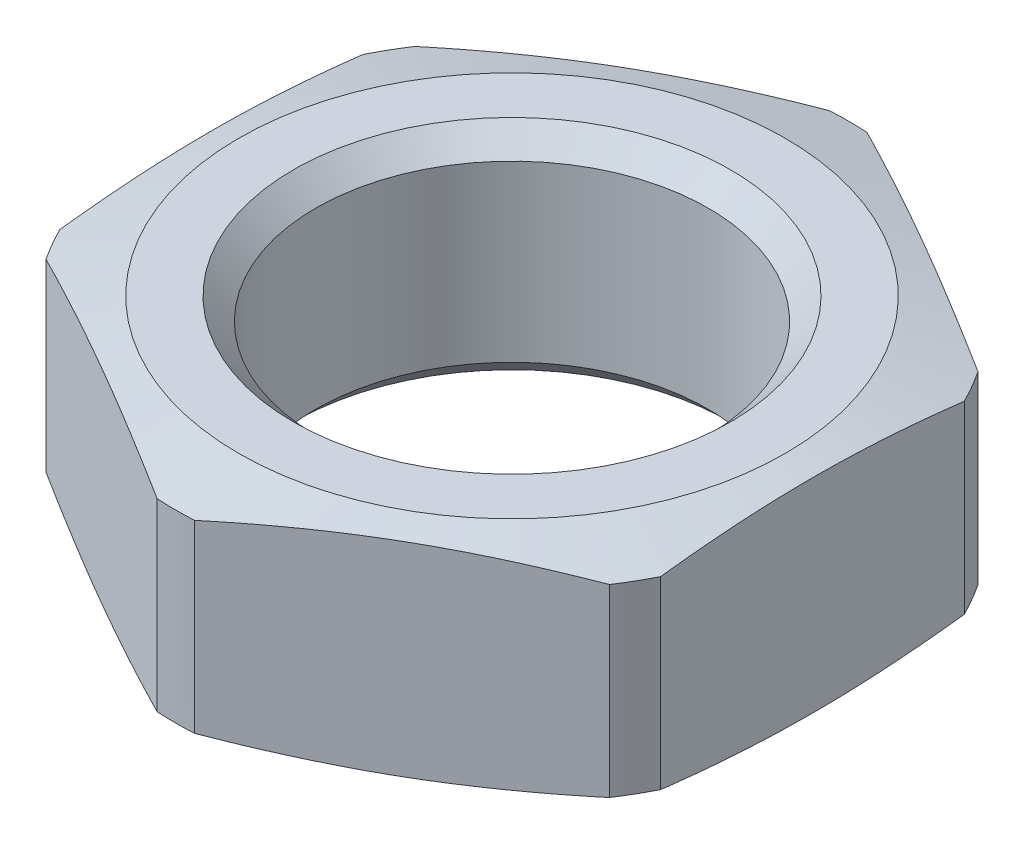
ISO-10303-21;
HEADER;
FILE_DESCRIPTION(('STEP AP214'),'2;1');
FILE_NAME('part.step','',(''),(''),'','','');
FILE_SCHEMA(('AUTOMOTIVE_DESIGN { 1 0 10303 214 1 1 1 1 }'));
ENDSEC;
DATA;
#1=APPLICATION_CONTEXT('core data for automotive mechanical design processes');
#2=APPLICATION_PROTOCOL_DEFINITION('international standard','automotive_design',2000,#1);
#3=PRODUCT_CONTEXT('',#1,'mechanical');
#4=PRODUCT('Part','Part','',(#3));
#5=PRODUCT_RELATED_PRODUCT_CATEGORY('part','',(#4));
#6=PRODUCT_DEFINITION_FORMATION('','',#4);
#7=PRODUCT_DEFINITION_CONTEXT('part definition',#1,'design');
#8=PRODUCT_DEFINITION('design','',#6,#7);
#9=PRODUCT_DEFINITION_SHAPE('','',#8);
#10=(LENGTH_UNIT() NAMED_UNIT(*) SI_UNIT(.MILLI.,.METRE.));
#11=(NAMED_UNIT(*) PLANE_ANGLE_UNIT() SI_UNIT($,.RADIAN.));
#12=(NAMED_UNIT(*) SI_UNIT($,.STERADIAN.) SOLID_ANGLE_UNIT());
#13=UNCERTAINTY_MEASURE_WITH_UNIT(LENGTH_MEASURE(1.E-05),#10,'distance_accuracy_value','');
#14=(GEOMETRIC_REPRESENTATION_CONTEXT(3) GLOBAL_UNCERTAINTY_ASSIGNED_CONTEXT((#13)) GLOBAL_UNIT_ASSIGNED_CONTEXT((#10,
#11,#12)) REPRESENTATION_CONTEXT('',''));
#15=CARTESIAN_POINT('',(0.,0.,0.));
#16=DIRECTION('',(0.,0.,1.));
#17=DIRECTION('',(1.,0.,0.));
#18=AXIS2_PLACEMENT_3D('',#15,#16,#17);
#19=CARTESIAN_POINT('',(0.,0.,0.));
#20=DIRECTION('',(0.,1.,0.));
#21=DIRECTION('',(0.,0.,1.));
#22=AXIS2_PLACEMENT_3D('',#19,#20,#21);
#23=CONICAL_SURFACE('',#22,5.,1.30899693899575);
#24=CARTESIAN_POINT('',(0.,0.,0.));
#25=DIRECTION('',(0.,1.,0.));
#26=DIRECTION('',(0.,0.,1.));
#27=AXIS2_PLACEMENT_3D('',#24,#25,#26);
#28=CIRCLE('',#27,5.);
#29=CARTESIAN_POINT('',(0.,0.,5.));
#30=VERTEX_POINT('',#29);
#31=EDGE_CURVE('E544',#30,#30,#28,.T.);
#32=ORIENTED_EDGE('',*,*,#31,.T.);
#33=EDGE_LOOP('',(#32));
#34=FACE_BOUND('',#33,.T.);
#35=CARTESIAN_POINT('',(0.,0.311481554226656,0.));
#36=DIRECTION('',(0.,1.,0.));
#37=DIRECTION('',(0.,0.,1.));
#38=AXIS2_PLACEMENT_3D('',#35,#36,#37);
#39=CIRCLE('',#38,6.1624649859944);
#40=CARTESIAN_POINT('',(5.15717282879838,0.311481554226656,3.37335784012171));
#41=VERTEX_POINT('',#40);
#42=CARTESIAN_POINT('',(5.5,0.311481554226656,2.7795637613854));
#43=VERTEX_POINT('',#42);
#44=EDGE_CURVE('E261',#41,#43,#39,.T.);
#45=ORIENTED_EDGE('',*,*,#44,.F.);
#46=CARTESIAN_POINT('',(-0.000200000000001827,0.361990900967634,6.35096843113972));
#47=CARTESIAN_POINT('',(0.22821775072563,0.32663925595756,6.21909138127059));
#48=CARTESIAN_POINT('',(0.457049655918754,0.294545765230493,6.08697521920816));
#49=CARTESIAN_POINT('',(0.915521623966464,0.238160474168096,5.82227630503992));
#50=CARTESIAN_POINT('',(1.14516197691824,0.213871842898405,5.68969338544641));
#51=CARTESIAN_POINT('',(1.60385849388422,0.17451425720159,5.42486482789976));
#52=CARTESIAN_POINT('',(1.8329115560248,0.159398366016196,5.29262098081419));
#53=CARTESIAN_POINT('',(2.29130978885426,0.139129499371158,5.02796463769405));
#54=CARTESIAN_POINT('',(2.52065489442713,0.133974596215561,4.89555217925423));
#55=CARTESIAN_POINT('',(2.97934510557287,0.133974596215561,4.63072726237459));
#56=CARTESIAN_POINT('',(3.20869021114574,0.139129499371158,4.49831480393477));
#57=CARTESIAN_POINT('',(3.6670884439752,0.159398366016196,4.23365846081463));
#58=CARTESIAN_POINT('',(3.89614150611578,0.17451425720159,4.10141461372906));
#59=CARTESIAN_POINT('',(4.35483802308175,0.213871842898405,3.83658605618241));
#60=CARTESIAN_POINT('',(4.58447837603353,0.238160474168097,3.7040031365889));
#61=CARTESIAN_POINT('',(5.04295034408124,0.294545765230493,3.43930422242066));
#62=CARTESIAN_POINT('',(5.27178224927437,0.326639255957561,3.30718806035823));
#63=CARTESIAN_POINT('',(5.5002,0.361990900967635,3.1753110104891));
#64=B_SPLINE_CURVE_WITH_KNOTS('',3,(#46,#47,#48,#49,#50,#51,#52,#53,#54,#55,#56,#57,#58,#59,#60,
#61,#62,#63),.UNSPECIFIED.,.F.,.F.,(4,2,2,2,2,2,2,2,4),(0.,0.798379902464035,1.59708356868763,
2.3916650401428,3.1860927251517,3.9805204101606,4.77510188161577,5.57380554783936,
6.37218545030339),.UNSPECIFIED.);
#65=CARTESIAN_POINT('',(0.342827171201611,0.311481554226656,6.15292160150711));
#66=VERTEX_POINT('',#65);
#67=EDGE_CURVE('E169',#66,#41,#64,.T.);
#68=ORIENTED_EDGE('',*,*,#67,.F.);
#69=CARTESIAN_POINT('',(-0.342827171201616,0.311481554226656,6.15292160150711));
#70=VERTEX_POINT('',#69);
#71=EDGE_CURVE('E246',#70,#66,#39,.T.);
#72=ORIENTED_EDGE('',*,*,#71,.F.);
#73=CARTESIAN_POINT('',(-5.5002,0.361990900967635,3.1753110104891));
#74=CARTESIAN_POINT('',(-5.27178224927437,0.326639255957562,3.30718806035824));
#75=CARTESIAN_POINT('',(-5.04295034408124,0.294545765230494,3.43930422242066));
#76=CARTESIAN_POINT('',(-4.58447837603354,0.238160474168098,3.70400313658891));
#77=CARTESIAN_POINT('',(-4.35483802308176,0.213871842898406,3.83658605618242));
#78=CARTESIAN_POINT('',(-3.89614150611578,0.174514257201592,4.10141461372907));
#79=CARTESIAN_POINT('',(-3.6670884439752,0.159398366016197,4.23365846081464));
#80=CARTESIAN_POINT('',(-3.20869021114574,0.13912949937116,4.49831480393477));
#81=CARTESIAN_POINT('',(-2.97934510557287,0.133974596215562,4.63072726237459));
#82=CARTESIAN_POINT('',(-2.52065489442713,0.133974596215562,4.89555217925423));
#83=CARTESIAN_POINT('',(-2.29130978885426,0.13912949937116,5.02796463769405));
#84=CARTESIAN_POINT('',(-1.8329115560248,0.159398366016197,5.29262098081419));
#85=CARTESIAN_POINT('',(-1.60385849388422,0.174514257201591,5.42486482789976));
#86=CARTESIAN_POINT('',(-1.14516197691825,0.213871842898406,5.68969338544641));
#87=CARTESIAN_POINT('',(-0.91552162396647,0.238160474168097,5.82227630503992));
#88=CARTESIAN_POINT('',(-0.45704965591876,0.294545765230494,6.08697521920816));
#89=CARTESIAN_POINT('',(-0.228217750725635,0.326639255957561,6.21909138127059));
#90=CARTESIAN_POINT('',(0.000199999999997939,0.361990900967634,6.35096843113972));
#91=B_SPLINE_CURVE_WITH_KNOTS('',3,(#73,#74,#75,#76,#77,#78,#79,#80,#81,#82,#83,#84,#85,#86,#87,
#88,#89,#90),.UNSPECIFIED.,.F.,.F.,(4,2,2,2,2,2,2,2,4),(0.,0.798379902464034,1.59708356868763,
2.3916650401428,3.18609272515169,3.98052041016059,4.77510188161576,5.57380554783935,
6.37218545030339),.UNSPECIFIED.);
#92=CARTESIAN_POINT('',(-5.15717282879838,0.311481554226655,3.37335784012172));
#93=VERTEX_POINT('',#92);
#94=EDGE_CURVE('E162',#93,#70,#91,.T.);
#95=ORIENTED_EDGE('',*,*,#94,.F.);
#96=CARTESIAN_POINT('',(-5.5,0.311481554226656,2.7795637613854));
#97=VERTEX_POINT('',#96);
#98=EDGE_CURVE('E109',#97,#93,#39,.T.);
#99=ORIENTED_EDGE('',*,*,#98,.F.);
#100=CARTESIAN_POINT('',(-5.5,1.37396411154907,-8.50413932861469));
#101=CARTESIAN_POINT('',(-5.5,1.31755688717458,-8.25336836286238));
#102=CARTESIAN_POINT('',(-5.5,1.26182243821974,-8.00244337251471));
#103=CARTESIAN_POINT('',(-5.5,1.15206250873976,-7.50020944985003));
#104=CARTESIAN_POINT('',(-5.5,1.09803709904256,-7.24890050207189));
#105=CARTESIAN_POINT('',(-5.5,0.992015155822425,-6.74561452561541));
#106=CARTESIAN_POINT('',(-5.5,0.94002051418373,-6.49363709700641));
#107=CARTESIAN_POINT('',(-5.5,0.838604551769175,-5.98916516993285));
#108=CARTESIAN_POINT('',(-5.5,0.789183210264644,-5.73667067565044));
#109=CARTESIAN_POINT('',(-5.5,0.693926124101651,-5.23317212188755));
#110=CARTESIAN_POINT('',(-5.5,0.648064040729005,-4.98217306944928));
#111=CARTESIAN_POINT('',(-5.5,0.560230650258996,-4.47949627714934));
#112=CARTESIAN_POINT('',(-5.5,0.518259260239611,-4.22781855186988));
#113=CARTESIAN_POINT('',(-5.5,0.43912969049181,-3.72372130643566));
#114=CARTESIAN_POINT('',(-5.5,0.401971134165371,-3.47130184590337));
#115=CARTESIAN_POINT('',(-5.5,0.333543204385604,-2.9656567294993));
#116=CARTESIAN_POINT('',(-5.5,0.302273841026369,-2.71243107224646));
#117=CARTESIAN_POINT('',(-5.5,0.24648502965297,-2.20226254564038));
#118=CARTESIAN_POINT('',(-5.5,0.222047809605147,-1.9453105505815));
#119=CARTESIAN_POINT('',(-5.5,0.181596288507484,-1.43073857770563));
#120=CARTESIAN_POINT('',(-5.5,0.165581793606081,-1.17311861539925));
#121=CARTESIAN_POINT('',(-5.5,0.142908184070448,-0.657591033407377));
#122=CARTESIAN_POINT('',(-5.5,0.136244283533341,-0.399683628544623));
#123=CARTESIAN_POINT('',(-5.5,0.132683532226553,0.116199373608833));
#124=CARTESIAN_POINT('',(-5.5,0.13578665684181,0.374174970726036));
#125=CARTESIAN_POINT('',(-5.5,0.151589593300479,0.890862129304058));
#126=CARTESIAN_POINT('',(-5.5,0.164327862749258,1.14957249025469));
#127=CARTESIAN_POINT('',(-5.5,0.198668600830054,1.66639884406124));
#128=CARTESIAN_POINT('',(-5.5,0.220271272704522,1.92451482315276));
#129=CARTESIAN_POINT('',(-5.5,0.271224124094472,2.44015244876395));
#130=CARTESIAN_POINT('',(-5.5,0.300579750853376,2.69767354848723));
#131=CARTESIAN_POINT('',(-5.5,0.365784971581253,3.21188197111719));
#132=CARTESIAN_POINT('',(-5.5,0.401634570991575,3.46856929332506));
#133=CARTESIAN_POINT('',(-5.5,0.480460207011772,3.99319758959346));
#134=CARTESIAN_POINT('',(-5.5,0.523692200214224,4.26109975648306));
#135=CARTESIAN_POINT('',(-5.5,0.614815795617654,4.79611488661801));
#136=CARTESIAN_POINT('',(-5.5,0.662707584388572,5.06322781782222));
#137=CARTESIAN_POINT('',(-5.5,0.762202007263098,5.59679417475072));
#138=CARTESIAN_POINT('',(-5.5,0.813805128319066,5.86324750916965));
#139=CARTESIAN_POINT('',(-5.5,0.919969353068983,6.39556585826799));
#140=CARTESIAN_POINT('',(-5.5,0.974530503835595,6.6614308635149));
#141=CARTESIAN_POINT('',(-5.5,1.14177407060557,7.45848507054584));
#142=CARTESIAN_POINT('',(-5.5,1.25797841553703,7.98893401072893));
#143=CARTESIAN_POINT('',(-5.5,1.496487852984,9.0483960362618));
#144=CARTESIAN_POINT('',(-5.5,1.61879243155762,9.57740923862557));
#145=CARTESIAN_POINT('',(-5.5,1.86611349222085,10.6282572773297));
#146=CARTESIAN_POINT('',(-5.5,1.99108138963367,11.1501035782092));
#147=CARTESIAN_POINT('',(-5.5,2.24389518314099,12.1931106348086));
#148=CARTESIAN_POINT('',(-5.5,2.37174115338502,12.714271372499));
#149=CARTESIAN_POINT('',(-5.5,2.62931738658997,13.7552700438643));
#150=CARTESIAN_POINT('',(-5.5,2.75904442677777,14.2751087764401));
#151=CARTESIAN_POINT('',(-5.5,3.02007748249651,15.3143681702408));
#152=CARTESIAN_POINT('',(-5.5,3.15138343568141,15.8337888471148));
#153=CARTESIAN_POINT('',(-5.5,3.28323479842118,16.353069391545));
#154=B_SPLINE_CURVE_WITH_KNOTS('',3,(#100,#101,#102,#103,#104,#105,#106,#107,#108,#109,#110,
#111,#112,#113,#114,#115,#116,#117,#118,#119,#120,#121,#122,#123,#124,#125,#126,#127,#128,#129,
#130,#131,#132,#133,#134,#135,#136,#137,#138,#139,#140,#141,#142,#143,#144,#145,#146,#147,#148,
#149,#150,#151,#152,#153),.UNSPECIFIED.,.F.,.F.,(4,2,2,2,2,2,2,2,2,2,2,2,2,2,2,2,2,2,2,2,2,2,2,
2,2,2,4),(0.,0.771113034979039,1.54225798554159,2.31410499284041,3.08594578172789,
3.85138506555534,4.61680803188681,5.38217106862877,6.1475354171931,6.92174945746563,
7.6959456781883,8.46974549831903,9.2435433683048,10.0204461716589,10.7973667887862,
11.5748347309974,12.3523033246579,13.1663555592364,13.9804404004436,14.7946322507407,
15.6088370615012,17.2378558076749,18.8667375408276,20.4765283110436,22.0863606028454,
23.6937012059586,25.3009785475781),.UNSPECIFIED.);
#155=CARTESIAN_POINT('',(-5.5,0.311481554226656,-2.7795637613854));
#156=VERTEX_POINT('',#155);
#157=EDGE_CURVE('E208',#156,#97,#154,.T.);
#158=ORIENTED_EDGE('',*,*,#157,.F.);
#159=CARTESIAN_POINT('',(-5.15717282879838,0.311481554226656,-3.37335784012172));
#160=VERTEX_POINT('',#159);
#161=EDGE_CURVE('E249',#160,#156,#39,.T.);
#162=ORIENTED_EDGE('',*,*,#161,.F.);
#163=CARTESIAN_POINT('',(0.000199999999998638,0.361990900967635,-6.35096843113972));
#164=CARTESIAN_POINT('',(-0.228217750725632,0.326639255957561,-6.21909138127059));
#165=CARTESIAN_POINT('',(-0.457049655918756,0.294545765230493,-6.08697521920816));
#166=CARTESIAN_POINT('',(-0.915521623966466,0.238160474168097,-5.82227630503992));
#167=CARTESIAN_POINT('',(-1.14516197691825,0.213871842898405,-5.68969338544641));
#168=CARTESIAN_POINT('',(-1.60385849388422,0.174514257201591,-5.42486482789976));
#169=CARTESIAN_POINT('',(-1.8329115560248,0.159398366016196,-5.29262098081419));
#170=CARTESIAN_POINT('',(-2.29130978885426,0.139129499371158,-5.02796463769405));
#171=CARTESIAN_POINT('',(-2.52065489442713,0.133974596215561,-4.89555217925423));
#172=CARTESIAN_POINT('',(-2.97934510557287,0.133974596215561,-4.63072726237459));
#173=CARTESIAN_POINT('',(-3.20869021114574,0.139129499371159,-4.49831480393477));
#174=CARTESIAN_POINT('',(-3.6670884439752,0.159398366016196,-4.23365846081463));
#175=CARTESIAN_POINT('',(-3.89614150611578,0.174514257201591,-4.10141461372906));
#176=CARTESIAN_POINT('',(-4.35483802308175,0.213871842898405,-3.83658605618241));
#177=CARTESIAN_POINT('',(-4.58447837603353,0.238160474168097,-3.7040031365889));
#178=CARTESIAN_POINT('',(-5.04295034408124,0.294545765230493,-3.43930422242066));
#179=CARTESIAN_POINT('',(-5.27178224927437,0.326639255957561,-3.30718806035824));
#180=CARTESIAN_POINT('',(-5.5002,0.361990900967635,-3.1753110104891));
#181=B_SPLINE_CURVE_WITH_KNOTS('',3,(#163,#164,#165,#166,#167,#168,#169,#170,#171,#172,#173,
#174,#175,#176,#177,#178,#179,#180),.UNSPECIFIED.,.F.,.F.,(4,2,2,2,2,2,2,2,4),(0.,
0.798379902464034,1.59708356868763,2.3916650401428,3.18609272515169,3.98052041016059,
4.77510188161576,5.57380554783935,6.37218545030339),.UNSPECIFIED.);
#182=CARTESIAN_POINT('',(-0.342827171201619,0.311481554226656,-6.15292160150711));
#183=VERTEX_POINT('',#182);
#184=EDGE_CURVE('E201',#183,#160,#181,.T.);
#185=ORIENTED_EDGE('',*,*,#184,.F.);
#186=CARTESIAN_POINT('',(0.342827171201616,0.311481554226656,-6.15292160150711));
#187=VERTEX_POINT('',#186);
#188=EDGE_CURVE('E274',#187,#183,#39,.T.);
#189=ORIENTED_EDGE('',*,*,#188,.F.);
#190=CARTESIAN_POINT('',(5.5002,0.361990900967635,-3.1753110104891));
#191=CARTESIAN_POINT('',(5.27178224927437,0.326639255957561,-3.30718806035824));
#192=CARTESIAN_POINT('',(5.04295034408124,0.294545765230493,-3.43930422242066));
#193=CARTESIAN_POINT('',(4.58447837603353,0.238160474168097,-3.7040031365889));
#194=CARTESIAN_POINT('',(4.35483802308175,0.213871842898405,-3.83658605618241));
#195=CARTESIAN_POINT('',(3.89614150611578,0.174514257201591,-4.10141461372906));
#196=CARTESIAN_POINT('',(3.6670884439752,0.159398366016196,-4.23365846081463));
#197=CARTESIAN_POINT('',(3.20869021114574,0.139129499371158,-4.49831480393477));
#198=CARTESIAN_POINT('',(2.97934510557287,0.133974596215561,-4.63072726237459));
#199=CARTESIAN_POINT('',(2.52065489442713,0.133974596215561,-4.89555217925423));
#200=CARTESIAN_POINT('',(2.29130978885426,0.139129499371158,-5.02796463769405));
#201=CARTESIAN_POINT('',(1.8329115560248,0.159398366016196,-5.29262098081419));
#202=CARTESIAN_POINT('',(1.60385849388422,0.174514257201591,-5.42486482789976));
#203=CARTESIAN_POINT('',(1.14516197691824,0.213871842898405,-5.68969338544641));
#204=CARTESIAN_POINT('',(0.915521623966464,0.238160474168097,-5.82227630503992));
#205=CARTESIAN_POINT('',(0.457049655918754,0.294545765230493,-6.08697521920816));
#206=CARTESIAN_POINT('',(0.22821775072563,0.326639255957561,-6.21909138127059));
#207=CARTESIAN_POINT('',(-0.00020000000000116,0.361990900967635,-6.35096843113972));
#208=B_SPLINE_CURVE_WITH_KNOTS('',3,(#190,#191,#192,#193,#194,#195,#196,#197,#198,#199,#200,
#201,#202,#203,#204,#205,#206,#207),.UNSPECIFIED.,.F.,.F.,(4,2,2,2,2,2,2,2,4),(0.,
0.798379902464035,1.59708356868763,2.3916650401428,3.1860927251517,3.9805204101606,
4.77510188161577,5.57380554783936,6.37218545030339),.UNSPECIFIED.);
#209=CARTESIAN_POINT('',(5.15717282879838,0.311481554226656,-3.37335784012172));
#210=VERTEX_POINT('',#209);
#211=EDGE_CURVE('E194',#210,#187,#208,.T.);
#212=ORIENTED_EDGE('',*,*,#211,.F.);
#213=CARTESIAN_POINT('',(5.5,0.311481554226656,-2.7795637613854));
#214=VERTEX_POINT('',#213);
#215=EDGE_CURVE('E269',#214,#210,#39,.T.);
#216=ORIENTED_EDGE('',*,*,#215,.F.);
#217=CARTESIAN_POINT('',(5.5,1.37396411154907,-8.50413932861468));
#218=CARTESIAN_POINT('',(5.5,1.31755688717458,-8.25336836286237));
#219=CARTESIAN_POINT('',(5.5,1.26182243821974,-8.0024433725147));
#220=CARTESIAN_POINT('',(5.5,1.15206250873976,-7.50020944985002));
#221=CARTESIAN_POINT('',(5.5,1.09803709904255,-7.24890050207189));
#222=CARTESIAN_POINT('',(5.5,0.992015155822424,-6.74561452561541));
#223=CARTESIAN_POINT('',(5.5,0.940020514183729,-6.4936370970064));
#224=CARTESIAN_POINT('',(5.5,0.838604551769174,-5.98916516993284));
#225=CARTESIAN_POINT('',(5.5,0.789183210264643,-5.73667067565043));
#226=CARTESIAN_POINT('',(5.5,0.693926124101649,-5.23317212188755));
#227=CARTESIAN_POINT('',(5.5,0.648064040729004,-4.98217306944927));
#228=CARTESIAN_POINT('',(5.5,0.560230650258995,-4.47949627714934));
#229=CARTESIAN_POINT('',(5.5,0.51825926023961,-4.22781855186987));
#230=CARTESIAN_POINT('',(5.5,0.43912969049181,-3.72372130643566));
#231=CARTESIAN_POINT('',(5.5,0.40197113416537,-3.47130184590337));
#232=CARTESIAN_POINT('',(5.5,0.333543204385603,-2.9656567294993));
#233=CARTESIAN_POINT('',(5.5,0.302273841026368,-2.71243107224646));
#234=CARTESIAN_POINT('',(5.5,0.24648502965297,-2.20226254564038));
#235=CARTESIAN_POINT('',(5.5,0.222047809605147,-1.9453105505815));
#236=CARTESIAN_POINT('',(5.5,0.181596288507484,-1.43073857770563));
#237=CARTESIAN_POINT('',(5.5,0.165581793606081,-1.17311861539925));
#238=CARTESIAN_POINT('',(5.5,0.142908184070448,-0.657591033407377));
#239=CARTESIAN_POINT('',(5.5,0.136244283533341,-0.399683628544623));
#240=CARTESIAN_POINT('',(5.5,0.132683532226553,0.116199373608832));
#241=CARTESIAN_POINT('',(5.5,0.13578665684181,0.374174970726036));
#242=CARTESIAN_POINT('',(5.5,0.151589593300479,0.890862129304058));
#243=CARTESIAN_POINT('',(5.5,0.164327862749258,1.14957249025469));
#244=CARTESIAN_POINT('',(5.5,0.198668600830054,1.66639884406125));
#245=CARTESIAN_POINT('',(5.5,0.220271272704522,1.92451482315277));
#246=CARTESIAN_POINT('',(5.5,0.271224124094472,2.44015244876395));
#247=CARTESIAN_POINT('',(5.5,0.300579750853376,2.69767354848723));
#248=CARTESIAN_POINT('',(5.5,0.365784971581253,3.21188197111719));
#249=CARTESIAN_POINT('',(5.5,0.401634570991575,3.46856929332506));
#250=CARTESIAN_POINT('',(5.5,0.480460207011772,3.99319758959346));
#251=CARTESIAN_POINT('',(5.5,0.523692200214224,4.26109975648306));
#252=CARTESIAN_POINT('',(5.5,0.614815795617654,4.79611488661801));
#253=CARTESIAN_POINT('',(5.5,0.662707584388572,5.06322781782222));
#254=CARTESIAN_POINT('',(5.5,0.762202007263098,5.59679417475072));
#255=CARTESIAN_POINT('',(5.5,0.813805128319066,5.86324750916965));
#256=CARTESIAN_POINT('',(5.5,0.919969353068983,6.39556585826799));
#257=CARTESIAN_POINT('',(5.5,0.974530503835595,6.6614308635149));
#258=CARTESIAN_POINT('',(5.5,1.14177407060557,7.45848507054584));
#259=CARTESIAN_POINT('',(5.5,1.25797841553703,7.98893401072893));
#260=CARTESIAN_POINT('',(5.5,1.496487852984,9.0483960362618));
#261=CARTESIAN_POINT('',(5.5,1.61879243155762,9.57740923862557));
#262=CARTESIAN_POINT('',(5.5,1.86611349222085,10.6282572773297));
#263=CARTESIAN_POINT('',(5.5,1.99108138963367,11.1501035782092));
#264=CARTESIAN_POINT('',(5.5,2.24389518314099,12.1931106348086));
#265=CARTESIAN_POINT('',(5.5,2.37174115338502,12.714271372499));
#266=CARTESIAN_POINT('',(5.5,2.62931738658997,13.7552700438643));
#267=CARTESIAN_POINT('',(5.5,2.75904442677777,14.2751087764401));
#268=CARTESIAN_POINT('',(5.5,3.02007748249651,15.3143681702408));
#269=CARTESIAN_POINT('',(5.5,3.15138343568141,15.8337888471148));
#270=CARTESIAN_POINT('',(5.5,3.28323479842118,16.353069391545));
#271=B_SPLINE_CURVE_WITH_KNOTS('',3,(#217,#218,#219,#220,#221,#222,#223,#224,#225,#226,#227,
#228,#229,#230,#231,#232,#233,#234,#235,#236,#237,#238,#239,#240,#241,#242,#243,#244,#245,#246,
#247,#248,#249,#250,#251,#252,#253,#254,#255,#256,#257,#258,#259,#260,#261,#262,#263,#264,#265,
#266,#267,#268,#269,#270),.UNSPECIFIED.,.F.,.F.,(4,2,2,2,2,2,2,2,2,2,2,2,2,2,2,2,2,2,2,2,2,2,2,
2,2,2,4),(0.,0.771113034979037,1.54225798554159,2.31410499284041,3.08594578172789,
3.85138506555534,4.6168080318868,5.38217106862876,6.14753541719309,6.92174945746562,
7.69594567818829,8.46974549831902,9.24354336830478,10.0204461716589,10.7973667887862,
11.5748347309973,12.3523033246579,13.1663555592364,13.9804404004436,14.7946322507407,
15.6088370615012,17.2378558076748,18.8667375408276,20.4765283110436,22.0863606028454,
23.6937012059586,25.3009785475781),.UNSPECIFIED.);
#272=EDGE_CURVE('E188',#43,#214,#271,.F.);
#273=ORIENTED_EDGE('',*,*,#272,.F.);
#274=EDGE_LOOP('',(#45,#68,#72,#95,#99,#158,#162,#185,#189,#212,#216,#273));
#275=FACE_BOUND('',#274,.T.);
#276=ADVANCED_FACE('F16',(#34,#275),#23,.T.);
#277=CARTESIAN_POINT('',(0.,2.,0.));
#278=DIRECTION('',(0.,-1.,0.));
#279=DIRECTION('',(0.,0.,-1.));
#280=AXIS2_PLACEMENT_3D('',#277,#278,#279);
#281=CONICAL_SURFACE('',#280,12.4641016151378,1.30899693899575);
#282=CARTESIAN_POINT('',(0.,4.,0.));
#283=DIRECTION('',(0.,1.,0.));
#284=DIRECTION('',(0.,0.,1.));
#285=AXIS2_PLACEMENT_3D('',#282,#283,#284);
#286=CIRCLE('',#285,5.);
#287=CARTESIAN_POINT('',(0.,4.,5.));
#288=VERTEX_POINT('',#287);
#289=EDGE_CURVE('E539',#288,#288,#286,.T.);
#290=ORIENTED_EDGE('',*,*,#289,.F.);
#291=EDGE_LOOP('',(#290));
#292=FACE_BOUND('',#291,.T.);
#293=CARTESIAN_POINT('',(0.,3.68851844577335,0.));
#294=DIRECTION('',(0.,-1.,0.));
#295=DIRECTION('',(0.,0.,-1.));
#296=AXIS2_PLACEMENT_3D('',#293,#294,#295);
#297=CIRCLE('',#296,6.1624649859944);
#298=CARTESIAN_POINT('',(5.15717282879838,3.68851844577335,-3.37335784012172));
#299=VERTEX_POINT('',#298);
#300=CARTESIAN_POINT('',(5.5,3.68851844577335,-2.7795637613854));
#301=VERTEX_POINT('',#300);
#302=EDGE_CURVE('E264',#299,#301,#297,.T.);
#303=ORIENTED_EDGE('',*,*,#302,.F.);
#304=CARTESIAN_POINT('',(-0.000200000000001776,3.63800909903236,-6.35096843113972));
#305=CARTESIAN_POINT('',(0.22821775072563,3.67336074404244,-6.21909138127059));
#306=CARTESIAN_POINT('',(0.457049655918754,3.70545423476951,-6.08697521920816));
#307=CARTESIAN_POINT('',(0.915521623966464,3.76183952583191,-5.82227630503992));
#308=CARTESIAN_POINT('',(1.14516197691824,3.7861281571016,-5.68969338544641));
#309=CARTESIAN_POINT('',(1.60385849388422,3.82548574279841,-5.42486482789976));
#310=CARTESIAN_POINT('',(1.8329115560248,3.84060163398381,-5.29262098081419));
#311=CARTESIAN_POINT('',(2.29130978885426,3.86087050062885,-5.02796463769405));
#312=CARTESIAN_POINT('',(2.52065489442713,3.86602540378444,-4.89555217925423));
#313=CARTESIAN_POINT('',(2.97934510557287,3.86602540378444,-4.63072726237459));
#314=CARTESIAN_POINT('',(3.20869021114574,3.86087050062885,-4.49831480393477));
#315=CARTESIAN_POINT('',(3.6670884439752,3.84060163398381,-4.23365846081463));
#316=CARTESIAN_POINT('',(3.89614150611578,3.82548574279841,-4.10141461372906));
#317=CARTESIAN_POINT('',(4.35483802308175,3.7861281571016,-3.83658605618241));
#318=CARTESIAN_POINT('',(4.58447837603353,3.76183952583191,-3.7040031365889));
#319=CARTESIAN_POINT('',(5.04295034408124,3.70545423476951,-3.43930422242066));
#320=CARTESIAN_POINT('',(5.27178224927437,3.67336074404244,-3.30718806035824));
#321=CARTESIAN_POINT('',(5.5002,3.63800909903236,-3.1753110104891));
#322=B_SPLINE_CURVE_WITH_KNOTS('',3,(#304,#305,#306,#307,#308,#309,#310,#311,#312,#313,#314,
#315,#316,#317,#318,#319,#320,#321),.UNSPECIFIED.,.F.,.F.,(4,2,2,2,2,2,2,2,4),(0.,
0.798379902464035,1.59708356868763,2.3916650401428,3.1860927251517,3.9805204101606,
4.77510188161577,5.57380554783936,6.37218545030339),.UNSPECIFIED.);
#323=CARTESIAN_POINT('',(0.342827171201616,3.68851844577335,-6.15292160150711));
#324=VERTEX_POINT('',#323);
#325=EDGE_CURVE('E231',#324,#299,#322,.T.);
#326=ORIENTED_EDGE('',*,*,#325,.F.);
#327=CARTESIAN_POINT('',(-0.342827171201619,3.68851844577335,-6.15292160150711));
#328=VERTEX_POINT('',#327);
#329=EDGE_CURVE('E39',#328,#324,#297,.T.);
#330=ORIENTED_EDGE('',*,*,#329,.F.);
#331=CARTESIAN_POINT('',(-5.5002,3.63800909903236,-3.1753110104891));
#332=CARTESIAN_POINT('',(-5.27178224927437,3.67336074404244,-3.30718806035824));
#333=CARTESIAN_POINT('',(-5.04295034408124,3.70545423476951,-3.43930422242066));
#334=CARTESIAN_POINT('',(-4.58447837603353,3.76183952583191,-3.7040031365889));
#335=CARTESIAN_POINT('',(-4.35483802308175,3.7861281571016,-3.83658605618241));
#336=CARTESIAN_POINT('',(-3.89614150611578,3.82548574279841,-4.10141461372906));
#337=CARTESIAN_POINT('',(-3.6670884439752,3.84060163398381,-4.23365846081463));
#338=CARTESIAN_POINT('',(-3.20869021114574,3.86087050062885,-4.49831480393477));
#339=CARTESIAN_POINT('',(-2.97934510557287,3.86602540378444,-4.63072726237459));
#340=CARTESIAN_POINT('',(-2.52065489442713,3.86602540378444,-4.89555217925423));
#341=CARTESIAN_POINT('',(-2.29130978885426,3.86087050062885,-5.02796463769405));
#342=CARTESIAN_POINT('',(-1.8329115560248,3.84060163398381,-5.29262098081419));
#343=CARTESIAN_POINT('',(-1.60385849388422,3.82548574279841,-5.42486482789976));
#344=CARTESIAN_POINT('',(-1.14516197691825,3.7861281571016,-5.68969338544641));
#345=CARTESIAN_POINT('',(-0.915521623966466,3.76183952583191,-5.82227630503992));
#346=CARTESIAN_POINT('',(-0.457049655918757,3.70545423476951,-6.08697521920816));
#347=CARTESIAN_POINT('',(-0.228217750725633,3.67336074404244,-6.21909138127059));
#348=CARTESIAN_POINT('',(0.000199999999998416,3.63800909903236,-6.35096843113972));
#349=B_SPLINE_CURVE_WITH_KNOTS('',3,(#331,#332,#333,#334,#335,#336,#337,#338,#339,#340,#341,
#342,#343,#344,#345,#346,#347,#348),.UNSPECIFIED.,.F.,.F.,(4,2,2,2,2,2,2,2,4),(0.,
0.798379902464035,1.59708356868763,2.3916650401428,3.1860927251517,3.9805204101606,
4.77510188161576,5.57380554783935,6.37218545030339),.UNSPECIFIED.);
#350=CARTESIAN_POINT('',(-5.15717282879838,3.68851844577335,-3.37335784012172));
#351=VERTEX_POINT('',#350);
#352=EDGE_CURVE('E223',#351,#328,#349,.T.);
#353=ORIENTED_EDGE('',*,*,#352,.F.);
#354=CARTESIAN_POINT('',(-5.5,3.68851844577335,-2.7795637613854));
#355=VERTEX_POINT('',#354);
#356=EDGE_CURVE('E31',#355,#351,#297,.T.);
#357=ORIENTED_EDGE('',*,*,#356,.F.);
#358=CARTESIAN_POINT('',(-5.5,2.62603588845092,-8.50413932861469));
#359=CARTESIAN_POINT('',(-5.5,2.68244311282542,-8.25336836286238));
#360=CARTESIAN_POINT('',(-5.5,2.73817756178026,-8.00244337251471));
#361=CARTESIAN_POINT('',(-5.5,2.84793749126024,-7.50020944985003));
#362=CARTESIAN_POINT('',(-5.5,2.90196290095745,-7.2489005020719));
#363=CARTESIAN_POINT('',(-5.5,3.00798484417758,-6.74561452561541));
#364=CARTESIAN_POINT('',(-5.5,3.05997948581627,-6.49363709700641));
#365=CARTESIAN_POINT('',(-5.5,3.16139544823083,-5.98916516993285));
#366=CARTESIAN_POINT('',(-5.5,3.21081678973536,-5.73667067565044));
#367=CARTESIAN_POINT('',(-5.5,3.30607387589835,-5.23317212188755));
#368=CARTESIAN_POINT('',(-5.5,3.351935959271,-4.98217306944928));
#369=CARTESIAN_POINT('',(-5.5,3.43976934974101,-4.47949627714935));
#370=CARTESIAN_POINT('',(-5.5,3.48174073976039,-4.22781855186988));
#371=CARTESIAN_POINT('',(-5.5,3.56087030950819,-3.72372130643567));
#372=CARTESIAN_POINT('',(-5.5,3.59802886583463,-3.47130184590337));
#373=CARTESIAN_POINT('',(-5.5,3.6664567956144,-2.9656567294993));
#374=CARTESIAN_POINT('',(-5.5,3.69772615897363,-2.71243107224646));
#375=CARTESIAN_POINT('',(-5.5,3.75351497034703,-2.20226254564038));
#376=CARTESIAN_POINT('',(-5.5,3.77795219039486,-1.9453105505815));
#377=CARTESIAN_POINT('',(-5.5,3.81840371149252,-1.43073857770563));
#378=CARTESIAN_POINT('',(-5.5,3.83441820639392,-1.17311861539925));
#379=CARTESIAN_POINT('',(-5.5,3.85709181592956,-0.657591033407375));
#380=CARTESIAN_POINT('',(-5.5,3.86375571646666,-0.399683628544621));
#381=CARTESIAN_POINT('',(-5.5,3.86731646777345,0.116199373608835));
#382=CARTESIAN_POINT('',(-5.5,3.86421334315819,0.374174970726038));
#383=CARTESIAN_POINT('',(-5.5,3.84841040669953,0.89086212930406));
#384=CARTESIAN_POINT('',(-5.5,3.83567213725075,1.14957249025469));
#385=CARTESIAN_POINT('',(-5.5,3.80133139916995,1.66639884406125));
#386=CARTESIAN_POINT('',(-5.5,3.77972872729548,1.92451482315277));
#387=CARTESIAN_POINT('',(-5.5,3.72877587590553,2.44015244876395));
#388=CARTESIAN_POINT('',(-5.5,3.69942024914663,2.69767354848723));
#389=CARTESIAN_POINT('',(-5.5,3.63421502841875,3.2118819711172));
#390=CARTESIAN_POINT('',(-5.5,3.59836542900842,3.46856929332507));
#391=CARTESIAN_POINT('',(-5.5,3.51953979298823,3.99319758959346));
#392=CARTESIAN_POINT('',(-5.5,3.47630779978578,4.26109975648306));
#393=CARTESIAN_POINT('',(-5.5,3.38518420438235,4.79611488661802));
#394=CARTESIAN_POINT('',(-5.5,3.33729241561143,5.06322781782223));
#395=CARTESIAN_POINT('',(-5.5,3.2377979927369,5.59679417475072));
#396=CARTESIAN_POINT('',(-5.5,3.18619487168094,5.86324750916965));
#397=CARTESIAN_POINT('',(-5.5,3.08003064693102,6.395565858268));
#398=CARTESIAN_POINT('',(-5.5,3.02546949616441,6.66143086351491));
#399=CARTESIAN_POINT('',(-5.5,2.85822592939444,7.45848507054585));
#400=CARTESIAN_POINT('',(-5.5,2.74202158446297,7.98893401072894));
#401=CARTESIAN_POINT('',(-5.5,2.503512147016,9.04839603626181));
#402=CARTESIAN_POINT('',(-5.5,2.38120756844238,9.57740923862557));
#403=CARTESIAN_POINT('',(-5.5,2.13388650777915,10.6282572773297));
#404=CARTESIAN_POINT('',(-5.5,2.00891861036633,11.1501035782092));
#405=CARTESIAN_POINT('',(-5.5,1.75610481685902,12.1931106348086));
#406=CARTESIAN_POINT('',(-5.5,1.62825884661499,12.714271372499));
#407=CARTESIAN_POINT('',(-5.5,1.37068261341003,13.7552700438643));
#408=CARTESIAN_POINT('',(-5.5,1.24095557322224,14.2751087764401));
#409=CARTESIAN_POINT('',(-5.5,0.979922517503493,15.3143681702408));
#410=CARTESIAN_POINT('',(-5.5,0.848616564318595,15.8337888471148));
#411=CARTESIAN_POINT('',(-5.5,0.71676520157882,16.353069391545));
#412=B_SPLINE_CURVE_WITH_KNOTS('',3,(#358,#359,#360,#361,#362,#363,#364,#365,#366,#367,#368,
#369,#370,#371,#372,#373,#374,#375,#376,#377,#378,#379,#380,#381,#382,#383,#384,#385,#386,#387,
#388,#389,#390,#391,#392,#393,#394,#395,#396,#397,#398,#399,#400,#401,#402,#403,#404,#405,#406,
#407,#408,#409,#410,#411),.UNSPECIFIED.,.F.,.F.,(4,2,2,2,2,2,2,2,2,2,2,2,2,2,2,2,2,2,2,2,2,2,2,
2,2,2,4),(0.,0.771113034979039,1.54225798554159,2.31410499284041,3.08594578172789,
3.85138506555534,4.61680803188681,5.38217106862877,6.1475354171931,6.92174945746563,
7.69594567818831,8.46974549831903,9.2435433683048,10.0204461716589,10.7973667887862,
11.5748347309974,12.3523033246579,13.1663555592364,13.9804404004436,14.7946322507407,
15.6088370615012,17.2378558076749,18.8667375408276,20.4765283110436,22.0863606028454,
23.6937012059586,25.3009785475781),.UNSPECIFIED.);
#413=CARTESIAN_POINT('',(-5.5,3.68851844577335,2.7795637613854));
#414=VERTEX_POINT('',#413);
#415=EDGE_CURVE('E114',#414,#355,#412,.F.);
#416=ORIENTED_EDGE('',*,*,#415,.F.);
#417=CARTESIAN_POINT('',(-5.15717282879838,3.68851844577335,3.37335784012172));
#418=VERTEX_POINT('',#417);
#419=EDGE_CURVE('E106',#418,#414,#297,.T.);
#420=ORIENTED_EDGE('',*,*,#419,.F.);
#421=CARTESIAN_POINT('',(0.000199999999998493,3.63800909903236,6.35096843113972));
#422=CARTESIAN_POINT('',(-0.228217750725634,3.67336074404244,6.21909138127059));
#423=CARTESIAN_POINT('',(-0.457049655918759,3.70545423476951,6.08697521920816));
#424=CARTESIAN_POINT('',(-0.915521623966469,3.76183952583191,5.82227630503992));
#425=CARTESIAN_POINT('',(-1.14516197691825,3.7861281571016,5.68969338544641));
#426=CARTESIAN_POINT('',(-1.60385849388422,3.82548574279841,5.42486482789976));
#427=CARTESIAN_POINT('',(-1.8329115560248,3.84060163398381,5.29262098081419));
#428=CARTESIAN_POINT('',(-2.29130978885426,3.86087050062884,5.02796463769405));
#429=CARTESIAN_POINT('',(-2.52065489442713,3.86602540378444,4.89555217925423));
#430=CARTESIAN_POINT('',(-2.97934510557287,3.86602540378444,4.63072726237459));
#431=CARTESIAN_POINT('',(-3.20869021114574,3.86087050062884,4.49831480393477));
#432=CARTESIAN_POINT('',(-3.6670884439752,3.84060163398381,4.23365846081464));
#433=CARTESIAN_POINT('',(-3.89614150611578,3.82548574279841,4.10141461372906));
#434=CARTESIAN_POINT('',(-4.35483802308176,3.7861281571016,3.83658605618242));
#435=CARTESIAN_POINT('',(-4.58447837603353,3.76183952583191,3.70400313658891));
#436=CARTESIAN_POINT('',(-5.04295034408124,3.70545423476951,3.43930422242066));
#437=CARTESIAN_POINT('',(-5.27178224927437,3.67336074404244,3.30718806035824));
#438=CARTESIAN_POINT('',(-5.5002,3.63800909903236,3.1753110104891));
#439=B_SPLINE_CURVE_WITH_KNOTS('',3,(#421,#422,#423,#424,#425,#426,#427,#428,#429,#430,#431,
#432,#433,#434,#435,#436,#437,#438),.UNSPECIFIED.,.F.,.F.,(4,2,2,2,2,2,2,2,4),(0.,
0.798379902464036,1.59708356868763,2.3916650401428,3.1860927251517,3.98052041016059,
4.77510188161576,5.57380554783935,6.37218545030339),.UNSPECIFIED.);
#440=CARTESIAN_POINT('',(-0.342827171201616,3.68851844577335,6.15292160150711));
#441=VERTEX_POINT('',#440);
#442=EDGE_CURVE('E121',#441,#418,#439,.T.);
#443=ORIENTED_EDGE('',*,*,#442,.F.);
#444=CARTESIAN_POINT('',(0.342827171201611,3.68851844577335,6.15292160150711));
#445=VERTEX_POINT('',#444);
#446=EDGE_CURVE('E124',#445,#441,#297,.T.);
#447=ORIENTED_EDGE('',*,*,#446,.F.);
#448=CARTESIAN_POINT('',(5.5002,3.63800909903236,3.1753110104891));
#449=CARTESIAN_POINT('',(5.27178224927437,3.67336074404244,3.30718806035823));
#450=CARTESIAN_POINT('',(5.04295034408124,3.70545423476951,3.43930422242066));
#451=CARTESIAN_POINT('',(4.58447837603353,3.76183952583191,3.7040031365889));
#452=CARTESIAN_POINT('',(4.35483802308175,3.7861281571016,3.83658605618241));
#453=CARTESIAN_POINT('',(3.89614150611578,3.82548574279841,4.10141461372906));
#454=CARTESIAN_POINT('',(3.6670884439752,3.84060163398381,4.23365846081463));
#455=CARTESIAN_POINT('',(3.20869021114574,3.86087050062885,4.49831480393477));
#456=CARTESIAN_POINT('',(2.97934510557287,3.86602540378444,4.63072726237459));
#457=CARTESIAN_POINT('',(2.52065489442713,3.86602540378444,4.89555217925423));
#458=CARTESIAN_POINT('',(2.29130978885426,3.86087050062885,5.02796463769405));
#459=CARTESIAN_POINT('',(1.8329115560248,3.84060163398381,5.29262098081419));
#460=CARTESIAN_POINT('',(1.60385849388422,3.82548574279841,5.42486482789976));
#461=CARTESIAN_POINT('',(1.14516197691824,3.7861281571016,5.68969338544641));
#462=CARTESIAN_POINT('',(0.915521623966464,3.76183952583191,5.82227630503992));
#463=CARTESIAN_POINT('',(0.457049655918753,3.70545423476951,6.08697521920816));
#464=CARTESIAN_POINT('',(0.228217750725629,3.67336074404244,6.21909138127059));
#465=CARTESIAN_POINT('',(-0.000200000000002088,3.63800909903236,6.35096843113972));
#466=B_SPLINE_CURVE_WITH_KNOTS('',3,(#448,#449,#450,#451,#452,#453,#454,#455,#456,#457,#458,
#459,#460,#461,#462,#463,#464,#465),.UNSPECIFIED.,.F.,.F.,(4,2,2,2,2,2,2,2,4),(0.,
0.798379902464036,1.59708356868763,2.3916650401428,3.1860927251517,3.9805204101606,
4.77510188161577,5.57380554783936,6.3721854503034),.UNSPECIFIED.);
#467=CARTESIAN_POINT('',(5.15717282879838,3.68851844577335,3.37335784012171));
#468=VERTEX_POINT('',#467);
#469=EDGE_CURVE('E126',#468,#445,#466,.T.);
#470=ORIENTED_EDGE('',*,*,#469,.F.);
#471=CARTESIAN_POINT('',(5.5,3.68851844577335,2.7795637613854));
#472=VERTEX_POINT('',#471);
#473=EDGE_CURVE('E247',#472,#468,#297,.T.);
#474=ORIENTED_EDGE('',*,*,#473,.F.);
#475=CARTESIAN_POINT('',(5.5,2.62603588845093,-8.50413932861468));
#476=CARTESIAN_POINT('',(5.5,2.68244311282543,-8.25336836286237));
#477=CARTESIAN_POINT('',(5.5,2.73817756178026,-8.0024433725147));
#478=CARTESIAN_POINT('',(5.5,2.84793749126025,-7.50020944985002));
#479=CARTESIAN_POINT('',(5.5,2.90196290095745,-7.24890050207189));
#480=CARTESIAN_POINT('',(5.5,3.00798484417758,-6.74561452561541));
#481=CARTESIAN_POINT('',(5.5,3.05997948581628,-6.4936370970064));
#482=CARTESIAN_POINT('',(5.5,3.16139544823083,-5.98916516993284));
#483=CARTESIAN_POINT('',(5.5,3.21081678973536,-5.73667067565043));
#484=CARTESIAN_POINT('',(5.5,3.30607387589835,-5.23317212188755));
#485=CARTESIAN_POINT('',(5.5,3.351935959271,-4.98217306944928));
#486=CARTESIAN_POINT('',(5.5,3.43976934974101,-4.47949627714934));
#487=CARTESIAN_POINT('',(5.5,3.48174073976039,-4.22781855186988));
#488=CARTESIAN_POINT('',(5.5,3.56087030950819,-3.72372130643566));
#489=CARTESIAN_POINT('',(5.5,3.59802886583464,-3.47130184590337));
#490=CARTESIAN_POINT('',(5.5,3.6664567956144,-2.9656567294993));
#491=CARTESIAN_POINT('',(5.5,3.69772615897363,-2.71243107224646));
#492=CARTESIAN_POINT('',(5.5,3.75351497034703,-2.20226254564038));
#493=CARTESIAN_POINT('',(5.5,3.77795219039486,-1.9453105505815));
#494=CARTESIAN_POINT('',(5.5,3.81840371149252,-1.43073857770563));
#495=CARTESIAN_POINT('',(5.5,3.83441820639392,-1.17311861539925));
#496=CARTESIAN_POINT('',(5.5,3.85709181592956,-0.657591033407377));
#497=CARTESIAN_POINT('',(5.5,3.86375571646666,-0.399683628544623));
#498=CARTESIAN_POINT('',(5.5,3.86731646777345,0.116199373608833));
#499=CARTESIAN_POINT('',(5.5,3.86421334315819,0.374174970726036));
#500=CARTESIAN_POINT('',(5.5,3.84841040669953,0.890862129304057));
#501=CARTESIAN_POINT('',(5.5,3.83567213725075,1.14957249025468));
#502=CARTESIAN_POINT('',(5.5,3.80133139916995,1.66639884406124));
#503=CARTESIAN_POINT('',(5.5,3.77972872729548,1.92451482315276));
#504=CARTESIAN_POINT('',(5.5,3.72877587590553,2.44015244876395));
#505=CARTESIAN_POINT('',(5.5,3.69942024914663,2.69767354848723));
#506=CARTESIAN_POINT('',(5.5,3.63421502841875,3.21188197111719));
#507=CARTESIAN_POINT('',(5.5,3.59836542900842,3.46856929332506));
#508=CARTESIAN_POINT('',(5.5,3.51953979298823,3.99319758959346));
#509=CARTESIAN_POINT('',(5.5,3.47630779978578,4.26109975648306));
#510=CARTESIAN_POINT('',(5.5,3.38518420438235,4.79611488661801));
#511=CARTESIAN_POINT('',(5.5,3.33729241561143,5.06322781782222));
#512=CARTESIAN_POINT('',(5.5,3.23779799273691,5.59679417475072));
#513=CARTESIAN_POINT('',(5.5,3.18619487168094,5.86324750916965));
#514=CARTESIAN_POINT('',(5.5,3.08003064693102,6.39556585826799));
#515=CARTESIAN_POINT('',(5.5,3.02546949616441,6.6614308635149));
#516=CARTESIAN_POINT('',(5.5,2.85822592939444,7.45848507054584));
#517=CARTESIAN_POINT('',(5.5,2.74202158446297,7.98893401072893));
#518=CARTESIAN_POINT('',(5.5,2.503512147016,9.0483960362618));
#519=CARTESIAN_POINT('',(5.5,2.38120756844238,9.57740923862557));
#520=CARTESIAN_POINT('',(5.5,2.13388650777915,10.6282572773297));
#521=CARTESIAN_POINT('',(5.5,2.00891861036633,11.1501035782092));
#522=CARTESIAN_POINT('',(5.5,1.75610481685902,12.1931106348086));
#523=CARTESIAN_POINT('',(5.5,1.62825884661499,12.714271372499));
#524=CARTESIAN_POINT('',(5.5,1.37068261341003,13.7552700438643));
#525=CARTESIAN_POINT('',(5.5,1.24095557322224,14.2751087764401));
#526=CARTESIAN_POINT('',(5.5,0.979922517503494,15.3143681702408));
#527=CARTESIAN_POINT('',(5.5,0.848616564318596,15.8337888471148));
#528=CARTESIAN_POINT('',(5.5,0.716765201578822,16.353069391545));
#529=B_SPLINE_CURVE_WITH_KNOTS('',3,(#475,#476,#477,#478,#479,#480,#481,#482,#483,#484,#485,
#486,#487,#488,#489,#490,#491,#492,#493,#494,#495,#496,#497,#498,#499,#500,#501,#502,#503,#504,
#505,#506,#507,#508,#509,#510,#511,#512,#513,#514,#515,#516,#517,#518,#519,#520,#521,#522,#523,
#524,#525,#526,#527,#528),.UNSPECIFIED.,.F.,.F.,(4,2,2,2,2,2,2,2,2,2,2,2,2,2,2,2,2,2,2,2,2,2,2,
2,2,2,4),(0.,0.771113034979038,1.54225798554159,2.3141049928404,3.08594578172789,
3.85138506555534,4.6168080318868,5.38217106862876,6.14753541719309,6.92174945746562,
7.69594567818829,8.46974549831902,9.24354336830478,10.0204461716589,10.7973667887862,
11.5748347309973,12.3523033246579,13.1663555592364,13.9804404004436,14.7946322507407,
15.6088370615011,17.2378558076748,18.8667375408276,20.4765283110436,22.0863606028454,
23.6937012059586,25.3009785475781),.UNSPECIFIED.);
#530=EDGE_CURVE('E130',#301,#472,#529,.T.);
#531=ORIENTED_EDGE('',*,*,#530,.F.);
#532=EDGE_LOOP('',(#303,#326,#330,#353,#357,#416,#420,#443,#447,#470,#474,#531));
#533=FACE_BOUND('',#532,.T.);
#534=ADVANCED_FACE('F119',(#292,#533),#281,.T.);
#535=CARTESIAN_POINT('',(-5.5,-4.,-3.17542648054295));
#536=DIRECTION('',(-1.,0.,0.));
#537=DIRECTION('',(0.,0.,1.));
#538=AXIS2_PLACEMENT_3D('',#535,#536,#537);
#539=PLANE('',#538);
#540=ORIENTED_EDGE('',*,*,#157,.T.);
#541=DIRECTION('',(0.,1.,0.));
#542=VECTOR('',#541,1.);
#543=CARTESIAN_POINT('',(-5.5,-4.,2.7795637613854));
#544=LINE('',#543,#542);
#545=EDGE_CURVE('E244',#97,#414,#544,.T.);
#546=ORIENTED_EDGE('',*,*,#545,.T.);
#547=ORIENTED_EDGE('',*,*,#415,.T.);
#548=DIRECTION('',(0.,1.,0.));
#549=VECTOR('',#548,1.);
#550=CARTESIAN_POINT('',(-5.5,-4.,-2.7795637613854));
#551=LINE('',#550,#549);
#552=EDGE_CURVE('E170',#355,#156,#551,.F.);
#553=ORIENTED_EDGE('',*,*,#552,.T.);
#554=EDGE_LOOP('',(#540,#546,#547,#553));
#555=FACE_BOUND('',#554,.T.);
#556=ADVANCED_FACE('F157',(#555),#539,.T.);
#557=CARTESIAN_POINT('',(0.,-4.,-6.35085296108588));
#558=DIRECTION('',(-0.5,0.,-0.866025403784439));
#559=DIRECTION('',(-0.866025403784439,0.,0.5));
#560=AXIS2_PLACEMENT_3D('',#557,#558,#559);
#561=PLANE('',#560);
#562=ORIENTED_EDGE('',*,*,#184,.T.);
#563=DIRECTION('',(0.,1.,0.));
#564=VECTOR('',#563,1.);
#565=CARTESIAN_POINT('',(-5.15717282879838,-4.,-3.37335784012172));
#566=LINE('',#565,#564);
#567=EDGE_CURVE('E273',#160,#351,#566,.T.);
#568=ORIENTED_EDGE('',*,*,#567,.T.);
#569=ORIENTED_EDGE('',*,*,#352,.T.);
#570=DIRECTION('',(0.,1.,0.));
#571=VECTOR('',#570,1.);
#572=CARTESIAN_POINT('',(-0.34282717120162,-4.,-6.15292160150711));
#573=LINE('',#572,#571);
#574=EDGE_CURVE('E271',#328,#183,#573,.F.);
#575=ORIENTED_EDGE('',*,*,#574,.T.);
#576=EDGE_LOOP('',(#562,#568,#569,#575));
#577=FACE_BOUND('',#576,.T.);
#578=ADVANCED_FACE('F214',(#577),#561,.T.);
#579=CARTESIAN_POINT('',(5.5,-4.,-3.17542648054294));
#580=DIRECTION('',(0.5,0.,-0.866025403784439));
#581=DIRECTION('',(-0.866025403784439,0.,-0.5));
#582=AXIS2_PLACEMENT_3D('',#579,#580,#581);
#583=PLANE('',#582);
#584=ORIENTED_EDGE('',*,*,#211,.T.);
#585=DIRECTION('',(0.,1.,0.));
#586=VECTOR('',#585,1.);
#587=CARTESIAN_POINT('',(0.342827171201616,-4.,-6.15292160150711));
#588=LINE('',#587,#586);
#589=EDGE_CURVE('E268',#187,#324,#588,.T.);
#590=ORIENTED_EDGE('',*,*,#589,.T.);
#591=ORIENTED_EDGE('',*,*,#325,.T.);
#592=DIRECTION('',(0.,1.,0.));
#593=VECTOR('',#592,1.);
#594=CARTESIAN_POINT('',(5.15717282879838,-4.,-3.37335784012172));
#595=LINE('',#594,#593);
#596=EDGE_CURVE('E265',#299,#210,#595,.F.);
#597=ORIENTED_EDGE('',*,*,#596,.T.);
#598=EDGE_LOOP('',(#584,#590,#591,#597));
#599=FACE_BOUND('',#598,.T.);
#600=ADVANCED_FACE('F218',(#599),#583,.T.);
#601=CARTESIAN_POINT('',(5.5,-4.,3.17542648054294));
#602=DIRECTION('',(1.,0.,0.));
#603=DIRECTION('',(0.,0.,-1.));
#604=AXIS2_PLACEMENT_3D('',#601,#602,#603);
#605=PLANE('',#604);
#606=ORIENTED_EDGE('',*,*,#272,.T.);
#607=DIRECTION('',(0.,1.,0.));
#608=VECTOR('',#607,1.);
#609=CARTESIAN_POINT('',(5.5,-4.,-2.7795637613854));
#610=LINE('',#609,#608);
#611=EDGE_CURVE('E260',#214,#301,#610,.T.);
#612=ORIENTED_EDGE('',*,*,#611,.T.);
#613=ORIENTED_EDGE('',*,*,#530,.T.);
#614=DIRECTION('',(0.,1.,0.));
#615=VECTOR('',#614,1.);
#616=CARTESIAN_POINT('',(5.5,-4.,2.7795637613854));
#617=LINE('',#616,#615);
#618=EDGE_CURVE('E257',#472,#43,#617,.F.);
#619=ORIENTED_EDGE('',*,*,#618,.T.);
#620=EDGE_LOOP('',(#606,#612,#613,#619));
#621=FACE_BOUND('',#620,.T.);
#622=ADVANCED_FACE('F307',(#621),#605,.T.);
#623=CARTESIAN_POINT('',(0.,-4.,6.35085296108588));
#624=DIRECTION('',(0.5,0.,0.866025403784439));
#625=DIRECTION('',(0.866025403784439,0.,-0.5));
#626=AXIS2_PLACEMENT_3D('',#623,#624,#625);
#627=PLANE('',#626);
#628=ORIENTED_EDGE('',*,*,#67,.T.);
#629=DIRECTION('',(0.,1.,0.));
#630=VECTOR('',#629,1.);
#631=CARTESIAN_POINT('',(5.15717282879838,-4.,3.37335784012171));
#632=LINE('',#631,#630);
#633=EDGE_CURVE('E254',#41,#468,#632,.T.);
#634=ORIENTED_EDGE('',*,*,#633,.T.);
#635=ORIENTED_EDGE('',*,*,#469,.T.);
#636=DIRECTION('',(0.,1.,0.));
#637=VECTOR('',#636,1.);
#638=CARTESIAN_POINT('',(0.342827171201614,-4.,6.15292160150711));
#639=LINE('',#638,#637);
#640=EDGE_CURVE('E251',#445,#66,#639,.F.);
#641=ORIENTED_EDGE('',*,*,#640,.T.);
#642=EDGE_LOOP('',(#628,#634,#635,#641));
#643=FACE_BOUND('',#642,.T.);
#644=ADVANCED_FACE('F154',(#643),#627,.T.);
#645=CARTESIAN_POINT('',(-5.5,-4.,3.17542648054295));
#646=DIRECTION('',(-0.5,0.,0.866025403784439));
#647=DIRECTION('',(0.866025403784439,0.,0.5));
#648=AXIS2_PLACEMENT_3D('',#645,#646,#647);
#649=PLANE('',#648);
#650=ORIENTED_EDGE('',*,*,#94,.T.);
#651=DIRECTION('',(0.,1.,0.));
#652=VECTOR('',#651,1.);
#653=CARTESIAN_POINT('',(-0.342827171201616,-4.,6.15292160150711));
#654=LINE('',#653,#652);
#655=EDGE_CURVE('E11',#70,#441,#654,.T.);
#656=ORIENTED_EDGE('',*,*,#655,.T.);
#657=ORIENTED_EDGE('',*,*,#442,.T.);
#658=DIRECTION('',(0.,1.,0.));
#659=VECTOR('',#658,1.);
#660=CARTESIAN_POINT('',(-5.15717282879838,-4.,3.37335784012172));
#661=LINE('',#660,#659);
#662=EDGE_CURVE('E24',#418,#93,#661,.F.);
#663=ORIENTED_EDGE('',*,*,#662,.T.);
#664=EDGE_LOOP('',(#650,#656,#657,#663));
#665=FACE_BOUND('',#664,.T.);
#666=ADVANCED_FACE('F125',(#665),#649,.T.);
#667=CARTESIAN_POINT('',(0.,0.,0.));
#668=DIRECTION('',(0.,1.,0.));
#669=DIRECTION('',(0.,0.,1.));
#670=AXIS2_PLACEMENT_3D('',#667,#668,#669);
#671=CYLINDRICAL_SURFACE('',#670,3.594);
#672=CARTESIAN_POINT('',(0.,0.406,0.));
#673=DIRECTION('',(0.,1.,0.));
#674=DIRECTION('',(0.,0.,1.));
#675=AXIS2_PLACEMENT_3D('',#672,#673,#674);
#676=CIRCLE('',#675,3.594);
#677=CARTESIAN_POINT('',(0.,0.406,3.594));
#678=VERTEX_POINT('',#677);
#679=EDGE_CURVE('E127',#678,#678,#676,.T.);
#680=ORIENTED_EDGE('',*,*,#679,.F.);
#681=EDGE_LOOP('',(#680));
#682=FACE_BOUND('',#681,.T.);
#683=CARTESIAN_POINT('',(0.,3.594,0.));
#684=DIRECTION('',(0.,1.,0.));
#685=DIRECTION('',(0.,0.,1.));
#686=AXIS2_PLACEMENT_3D('',#683,#684,#685);
#687=CIRCLE('',#686,3.594);
#688=CARTESIAN_POINT('',(0.,3.594,3.594));
#689=VERTEX_POINT('',#688);
#690=EDGE_CURVE('E536',#689,#689,#687,.T.);
#691=ORIENTED_EDGE('',*,*,#690,.T.);
#692=EDGE_LOOP('',(#691));
#693=FACE_BOUND('',#692,.T.);
#694=ADVANCED_FACE('F18',(#682,#693),#671,.F.);
#695=CARTESIAN_POINT('',(0.,0.406,0.));
#696=DIRECTION('',(0.,-1.,0.));
#697=DIRECTION('',(0.,0.,-1.));
#698=AXIS2_PLACEMENT_3D('',#695,#696,#697);
#699=CONICAL_SURFACE('',#698,3.594,0.785398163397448);
#700=CARTESIAN_POINT('',(0.,0.,0.));
#701=DIRECTION('',(0.,1.,0.));
#702=DIRECTION('',(0.,0.,1.));
#703=AXIS2_PLACEMENT_3D('',#700,#701,#702);
#704=CIRCLE('',#703,4.);
#705=CARTESIAN_POINT('',(0.,0.,4.));
#706=VERTEX_POINT('',#705);
#707=EDGE_CURVE('E133',#706,#706,#704,.T.);
#708=ORIENTED_EDGE('',*,*,#707,.F.);
#709=EDGE_LOOP('',(#708));
#710=FACE_BOUND('',#709,.T.);
#711=ORIENTED_EDGE('',*,*,#679,.T.);
#712=EDGE_LOOP('',(#711));
#713=FACE_BOUND('',#712,.T.);
#714=ADVANCED_FACE('F455',(#710,#713),#699,.F.);
#715=CARTESIAN_POINT('',(4.,0.,0.));
#716=DIRECTION('',(0.,1.,0.));
#717=DIRECTION('',(0.,0.,1.));
#718=AXIS2_PLACEMENT_3D('',#715,#716,#717);
#719=PLANE('',#718);
#720=ORIENTED_EDGE('',*,*,#31,.F.);
#721=EDGE_LOOP('',(#720));
#722=FACE_BOUND('',#721,.T.);
#723=ORIENTED_EDGE('',*,*,#707,.T.);
#724=EDGE_LOOP('',(#723));
#725=FACE_BOUND('',#724,.T.);
#726=ADVANCED_FACE('F181',(#722,#725),#719,.F.);
#727=CARTESIAN_POINT('',(5.,4.,0.));
#728=DIRECTION('',(0.,-1.,0.));
#729=DIRECTION('',(0.,0.,-1.));
#730=AXIS2_PLACEMENT_3D('',#727,#728,#729);
#731=PLANE('',#730);
#732=CARTESIAN_POINT('',(0.,4.,0.));
#733=DIRECTION('',(0.,1.,0.));
#734=DIRECTION('',(0.,0.,1.));
#735=AXIS2_PLACEMENT_3D('',#732,#733,#734);
#736=CIRCLE('',#735,4.);
#737=CARTESIAN_POINT('',(0.,4.,4.));
#738=VERTEX_POINT('',#737);
#739=EDGE_CURVE('E537',#738,#738,#736,.T.);
#740=ORIENTED_EDGE('',*,*,#739,.F.);
#741=EDGE_LOOP('',(#740));
#742=FACE_BOUND('',#741,.T.);
#743=ORIENTED_EDGE('',*,*,#289,.T.);
#744=EDGE_LOOP('',(#743));
#745=FACE_BOUND('',#744,.T.);
#746=ADVANCED_FACE('F438',(#742,#745),#731,.F.);
#747=CARTESIAN_POINT('',(0.,4.,0.));
#748=DIRECTION('',(0.,1.,0.));
#749=DIRECTION('',(0.,0.,1.));
#750=AXIS2_PLACEMENT_3D('',#747,#748,#749);
#751=CONICAL_SURFACE('',#750,4.,0.785398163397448);
#752=ORIENTED_EDGE('',*,*,#690,.F.);
#753=EDGE_LOOP('',(#752));
#754=FACE_BOUND('',#753,.T.);
#755=ORIENTED_EDGE('',*,*,#739,.T.);
#756=EDGE_LOOP('',(#755));
#757=FACE_BOUND('',#756,.T.);
#758=ADVANCED_FACE('F394',(#754,#757),#751,.F.);
#759=CARTESIAN_POINT('',(0.,-4.,0.));
#760=DIRECTION('',(0.,1.,0.));
#761=DIRECTION('',(0.,0.,1.));
#762=AXIS2_PLACEMENT_3D('',#759,#760,#761);
#763=CYLINDRICAL_SURFACE('',#762,6.1624649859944);
#764=ORIENTED_EDGE('',*,*,#98,.T.);
#765=ORIENTED_EDGE('',*,*,#662,.F.);
#766=ORIENTED_EDGE('',*,*,#419,.T.);
#767=ORIENTED_EDGE('',*,*,#545,.F.);
#768=EDGE_LOOP('',(#764,#765,#766,#767));
#769=FACE_BOUND('',#768,.T.);
#770=ADVANCED_FACE('F105',(#769),#763,.T.);
#771=ORIENTED_EDGE('',*,*,#446,.T.);
#772=ORIENTED_EDGE('',*,*,#655,.F.);
#773=ORIENTED_EDGE('',*,*,#71,.T.);
#774=ORIENTED_EDGE('',*,*,#640,.F.);
#775=EDGE_LOOP('',(#771,#772,#773,#774));
#776=FACE_BOUND('',#775,.T.);
#777=ADVANCED_FACE('F282',(#776),#763,.T.);
#778=ORIENTED_EDGE('',*,*,#473,.T.);
#779=ORIENTED_EDGE('',*,*,#633,.F.);
#780=ORIENTED_EDGE('',*,*,#44,.T.);
#781=ORIENTED_EDGE('',*,*,#618,.F.);
#782=EDGE_LOOP('',(#778,#779,#780,#781));
#783=FACE_BOUND('',#782,.T.);
#784=ADVANCED_FACE('F403',(#783),#763,.T.);
#785=ORIENTED_EDGE('',*,*,#302,.T.);
#786=ORIENTED_EDGE('',*,*,#611,.F.);
#787=ORIENTED_EDGE('',*,*,#215,.T.);
#788=ORIENTED_EDGE('',*,*,#596,.F.);
#789=EDGE_LOOP('',(#785,#786,#787,#788));
#790=FACE_BOUND('',#789,.T.);
#791=ADVANCED_FACE('F412',(#790),#763,.T.);
#792=ORIENTED_EDGE('',*,*,#329,.T.);
#793=ORIENTED_EDGE('',*,*,#589,.F.);
#794=ORIENTED_EDGE('',*,*,#188,.T.);
#795=ORIENTED_EDGE('',*,*,#574,.F.);
#796=EDGE_LOOP('',(#792,#793,#794,#795));
#797=FACE_BOUND('',#796,.T.);
#798=ADVANCED_FACE('F300',(#797),#763,.T.);
#799=ORIENTED_EDGE('',*,*,#356,.T.);
#800=ORIENTED_EDGE('',*,*,#567,.F.);
#801=ORIENTED_EDGE('',*,*,#161,.T.);
#802=ORIENTED_EDGE('',*,*,#552,.F.);
#803=EDGE_LOOP('',(#799,#800,#801,#802));
#804=FACE_BOUND('',#803,.T.);
#805=ADVANCED_FACE('F395',(#804),#763,.T.);
#806=CLOSED_SHELL('',(#276,#534,#556,#578,#600,#622,#644,#666,#694,#714,#726,#746,#758,#770,
#777,#784,#791,#798,#805));
#807=MANIFOLD_SOLID_BREP('B1',#806);
#808=ADVANCED_BREP_SHAPE_REPRESENTATION('',(#18,#807),#14);
#809=SHAPE_DEFINITION_REPRESENTATION(#9,#808);
ENDSEC;
END-ISO-10303-21;
